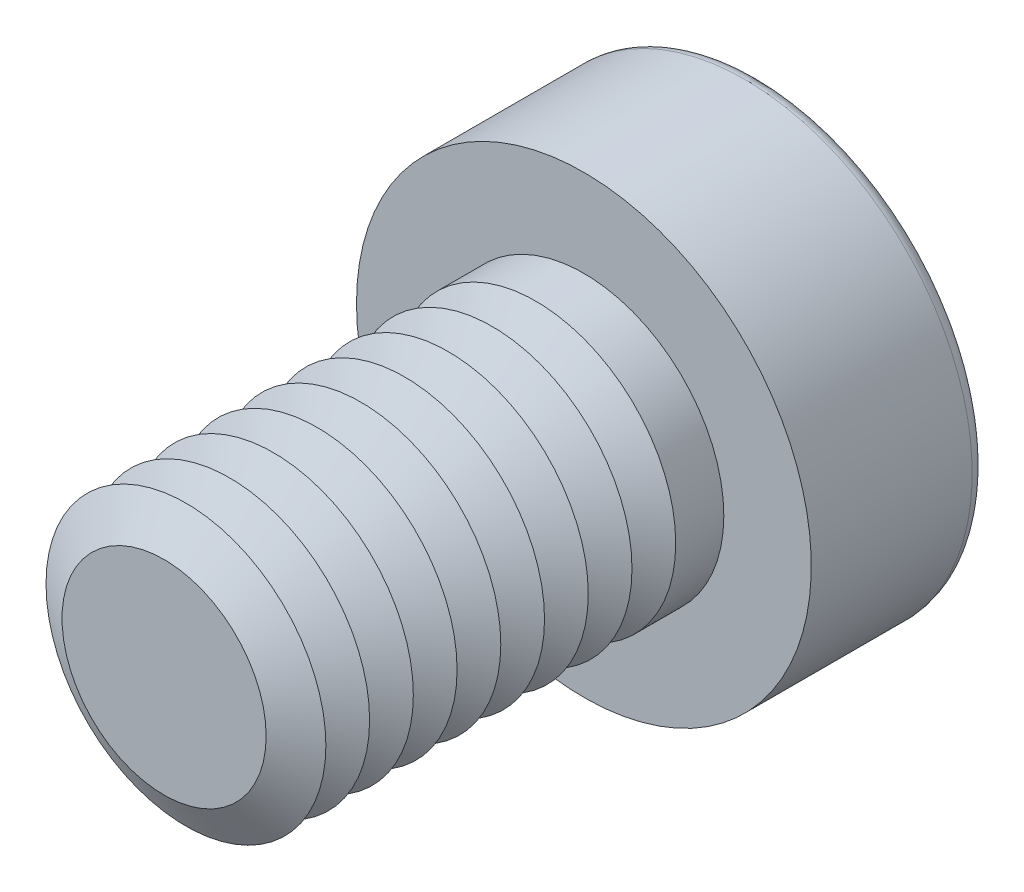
ISO-10303-21;
HEADER;
FILE_DESCRIPTION(('STEP AP214'),'2;1');
FILE_NAME('part.step','',(''),(''),'','','');
FILE_SCHEMA(('AUTOMOTIVE_DESIGN { 1 0 10303 214 1 1 1 1 }'));
ENDSEC;
DATA;
#1=APPLICATION_CONTEXT('core data for automotive mechanical design processes');
#2=APPLICATION_PROTOCOL_DEFINITION('international standard','automotive_design',2000,#1);
#3=PRODUCT_CONTEXT('',#1,'mechanical');
#4=PRODUCT('Part','Part','',(#3));
#5=PRODUCT_RELATED_PRODUCT_CATEGORY('part','',(#4));
#6=PRODUCT_DEFINITION_FORMATION('','',#4);
#7=PRODUCT_DEFINITION_CONTEXT('part definition',#1,'design');
#8=PRODUCT_DEFINITION('design','',#6,#7);
#9=PRODUCT_DEFINITION_SHAPE('','',#8);
#10=(LENGTH_UNIT() NAMED_UNIT(*) SI_UNIT(.MILLI.,.METRE.));
#11=(NAMED_UNIT(*) PLANE_ANGLE_UNIT() SI_UNIT($,.RADIAN.));
#12=(NAMED_UNIT(*) SI_UNIT($,.STERADIAN.) SOLID_ANGLE_UNIT());
#13=UNCERTAINTY_MEASURE_WITH_UNIT(LENGTH_MEASURE(1.E-05),#10,'distance_accuracy_value','');
#14=(GEOMETRIC_REPRESENTATION_CONTEXT(3) GLOBAL_UNCERTAINTY_ASSIGNED_CONTEXT((#13)) GLOBAL_UNIT_ASSIGNED_CONTEXT((#10,
#11,#12)) REPRESENTATION_CONTEXT('',''));
#15=CARTESIAN_POINT('',(0.,0.,0.));
#16=DIRECTION('',(0.,0.,1.));
#17=DIRECTION('',(1.,0.,0.));
#18=AXIS2_PLACEMENT_3D('',#15,#16,#17);
#19=CARTESIAN_POINT('',(0.,0.,7.625));
#20=DIRECTION('',(0.,0.,1.));
#21=DIRECTION('',(1.,0.,0.));
#22=AXIS2_PLACEMENT_3D('',#19,#20,#21);
#23=CONICAL_SURFACE('',#22,4.,1.0471975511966);
#24=CARTESIAN_POINT('',(0.,0.,7.));
#25=DIRECTION('',(0.,0.,1.));
#26=DIRECTION('',(1.,0.,0.));
#27=AXIS2_PLACEMENT_3D('',#24,#25,#26);
#28=CIRCLE('',#27,2.91746824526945);
#29=CARTESIAN_POINT('',(2.91746824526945,0.,7.));
#30=VERTEX_POINT('',#29);
#31=EDGE_CURVE('E314',#30,#30,#28,.T.);
#32=ORIENTED_EDGE('',*,*,#31,.T.);
#33=EDGE_LOOP('',(#32));
#34=FACE_BOUND('',#33,.T.);
#35=CARTESIAN_POINT('',(0.,0.,7.625));
#36=DIRECTION('',(0.,0.,1.));
#37=DIRECTION('',(1.,0.,0.));
#38=AXIS2_PLACEMENT_3D('',#35,#36,#37);
#39=CIRCLE('',#38,4.);
#40=CARTESIAN_POINT('',(4.,0.,7.625));
#41=VERTEX_POINT('',#40);
#42=EDGE_CURVE('E317',#41,#41,#39,.T.);
#43=ORIENTED_EDGE('',*,*,#42,.F.);
#44=EDGE_LOOP('',(#43));
#45=FACE_BOUND('',#44,.T.);
#46=ADVANCED_FACE('F39',(#34,#45),#23,.T.);
#47=CARTESIAN_POINT('',(0.,0.,7.));
#48=DIRECTION('',(0.,0.,-1.));
#49=DIRECTION('',(-1.,0.,0.));
#50=AXIS2_PLACEMENT_3D('',#47,#48,#49);
#51=CONICAL_SURFACE('',#50,2.91746824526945,1.0471975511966);
#52=CARTESIAN_POINT('',(0.,0.,6.375));
#53=DIRECTION('',(0.,0.,1.));
#54=DIRECTION('',(1.,0.,0.));
#55=AXIS2_PLACEMENT_3D('',#52,#53,#54);
#56=CIRCLE('',#55,4.);
#57=CARTESIAN_POINT('',(4.,0.,6.375));
#58=VERTEX_POINT('',#57);
#59=EDGE_CURVE('E325',#58,#58,#56,.T.);
#60=ORIENTED_EDGE('',*,*,#59,.T.);
#61=EDGE_LOOP('',(#60));
#62=FACE_BOUND('',#61,.T.);
#63=ORIENTED_EDGE('',*,*,#31,.F.);
#64=EDGE_LOOP('',(#63));
#65=FACE_BOUND('',#64,.T.);
#66=ADVANCED_FACE('F245',(#62,#65),#51,.T.);
#67=CARTESIAN_POINT('',(0.,0.,12.));
#68=DIRECTION('',(0.,0.,1.));
#69=DIRECTION('',(1.,0.,0.));
#70=AXIS2_PLACEMENT_3D('',#67,#68,#69);
#71=PLANE('',#70);
#72=CARTESIAN_POINT('',(0.,0.,12.));
#73=DIRECTION('',(0.,0.,1.));
#74=DIRECTION('',(1.,0.,0.));
#75=AXIS2_PLACEMENT_3D('',#72,#73,#74);
#76=CIRCLE('',#75,2.91746824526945);
#77=CARTESIAN_POINT('',(2.91746824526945,0.,12.));
#78=VERTEX_POINT('',#77);
#79=EDGE_CURVE('E174',#78,#78,#76,.T.);
#80=ORIENTED_EDGE('',*,*,#79,.T.);
#81=EDGE_LOOP('',(#80));
#82=FACE_BOUND('',#81,.T.);
#83=ADVANCED_FACE('F251',(#82),#71,.T.);
#84=CARTESIAN_POINT('',(0.,0.,12.));
#85=DIRECTION('',(0.,0.,-1.));
#86=DIRECTION('',(-1.,0.,0.));
#87=AXIS2_PLACEMENT_3D('',#84,#85,#86);
#88=CONICAL_SURFACE('',#87,2.91746824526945,1.0471975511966);
#89=CARTESIAN_POINT('',(0.,0.,11.375));
#90=DIRECTION('',(0.,0.,1.));
#91=DIRECTION('',(1.,0.,0.));
#92=AXIS2_PLACEMENT_3D('',#89,#90,#91);
#93=CIRCLE('',#92,4.);
#94=CARTESIAN_POINT('',(4.,0.,11.375));
#95=VERTEX_POINT('',#94);
#96=EDGE_CURVE('E291',#95,#95,#93,.T.);
#97=ORIENTED_EDGE('',*,*,#96,.T.);
#98=EDGE_LOOP('',(#97));
#99=FACE_BOUND('',#98,.T.);
#100=ORIENTED_EDGE('',*,*,#79,.F.);
#101=EDGE_LOOP('',(#100));
#102=FACE_BOUND('',#101,.T.);
#103=ADVANCED_FACE('F199',(#99,#102),#88,.T.);
#104=CARTESIAN_POINT('',(0.,0.,11.375));
#105=DIRECTION('',(0.,0.,1.));
#106=DIRECTION('',(1.,0.,0.));
#107=AXIS2_PLACEMENT_3D('',#104,#105,#106);
#108=CONICAL_SURFACE('',#107,4.,1.0471975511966);
#109=CARTESIAN_POINT('',(0.,0.,10.75));
#110=DIRECTION('',(0.,0.,1.));
#111=DIRECTION('',(1.,0.,0.));
#112=AXIS2_PLACEMENT_3D('',#109,#110,#111);
#113=CIRCLE('',#112,2.91746824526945);
#114=CARTESIAN_POINT('',(2.91746824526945,0.,10.75));
#115=VERTEX_POINT('',#114);
#116=EDGE_CURVE('E288',#115,#115,#113,.T.);
#117=ORIENTED_EDGE('',*,*,#116,.T.);
#118=EDGE_LOOP('',(#117));
#119=FACE_BOUND('',#118,.T.);
#120=ORIENTED_EDGE('',*,*,#96,.F.);
#121=EDGE_LOOP('',(#120));
#122=FACE_BOUND('',#121,.T.);
#123=ADVANCED_FACE('F277',(#119,#122),#108,.T.);
#124=CARTESIAN_POINT('',(0.,0.,10.75));
#125=DIRECTION('',(0.,0.,-1.));
#126=DIRECTION('',(-1.,0.,0.));
#127=AXIS2_PLACEMENT_3D('',#124,#125,#126);
#128=CONICAL_SURFACE('',#127,2.91746824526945,1.0471975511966);
#129=CARTESIAN_POINT('',(0.,0.,10.125));
#130=DIRECTION('',(0.,0.,1.));
#131=DIRECTION('',(1.,0.,0.));
#132=AXIS2_PLACEMENT_3D('',#129,#130,#131);
#133=CIRCLE('',#132,4.);
#134=CARTESIAN_POINT('',(4.,0.,10.125));
#135=VERTEX_POINT('',#134);
#136=EDGE_CURVE('E300',#135,#135,#133,.T.);
#137=ORIENTED_EDGE('',*,*,#136,.T.);
#138=EDGE_LOOP('',(#137));
#139=FACE_BOUND('',#138,.T.);
#140=ORIENTED_EDGE('',*,*,#116,.F.);
#141=EDGE_LOOP('',(#140));
#142=FACE_BOUND('',#141,.T.);
#143=ADVANCED_FACE('F274',(#139,#142),#128,.T.);
#144=CARTESIAN_POINT('',(0.,0.,10.125));
#145=DIRECTION('',(0.,0.,1.));
#146=DIRECTION('',(1.,0.,0.));
#147=AXIS2_PLACEMENT_3D('',#144,#145,#146);
#148=CONICAL_SURFACE('',#147,4.,1.0471975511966);
#149=CARTESIAN_POINT('',(0.,0.,9.5));
#150=DIRECTION('',(0.,0.,1.));
#151=DIRECTION('',(1.,0.,0.));
#152=AXIS2_PLACEMENT_3D('',#149,#150,#151);
#153=CIRCLE('',#152,2.91746824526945);
#154=CARTESIAN_POINT('',(2.91746824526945,0.,9.5));
#155=VERTEX_POINT('',#154);
#156=EDGE_CURVE('E293',#155,#155,#153,.T.);
#157=ORIENTED_EDGE('',*,*,#156,.T.);
#158=EDGE_LOOP('',(#157));
#159=FACE_BOUND('',#158,.T.);
#160=ORIENTED_EDGE('',*,*,#136,.F.);
#161=EDGE_LOOP('',(#160));
#162=FACE_BOUND('',#161,.T.);
#163=ADVANCED_FACE('F270',(#159,#162),#148,.T.);
#164=CARTESIAN_POINT('',(0.,0.,9.5));
#165=DIRECTION('',(0.,0.,-1.));
#166=DIRECTION('',(-1.,0.,0.));
#167=AXIS2_PLACEMENT_3D('',#164,#165,#166);
#168=CONICAL_SURFACE('',#167,2.91746824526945,1.0471975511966);
#169=CARTESIAN_POINT('',(0.,0.,8.875));
#170=DIRECTION('',(0.,0.,1.));
#171=DIRECTION('',(1.,0.,0.));
#172=AXIS2_PLACEMENT_3D('',#169,#170,#171);
#173=CIRCLE('',#172,4.);
#174=CARTESIAN_POINT('',(4.,0.,8.875));
#175=VERTEX_POINT('',#174);
#176=EDGE_CURVE('E310',#175,#175,#173,.T.);
#177=ORIENTED_EDGE('',*,*,#176,.T.);
#178=EDGE_LOOP('',(#177));
#179=FACE_BOUND('',#178,.T.);
#180=ORIENTED_EDGE('',*,*,#156,.F.);
#181=EDGE_LOOP('',(#180));
#182=FACE_BOUND('',#181,.T.);
#183=ADVANCED_FACE('F266',(#179,#182),#168,.T.);
#184=CARTESIAN_POINT('',(0.,0.,8.875));
#185=DIRECTION('',(0.,0.,1.));
#186=DIRECTION('',(1.,0.,0.));
#187=AXIS2_PLACEMENT_3D('',#184,#185,#186);
#188=CONICAL_SURFACE('',#187,4.,1.0471975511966);
#189=CARTESIAN_POINT('',(0.,0.,8.25));
#190=DIRECTION('',(0.,0.,1.));
#191=DIRECTION('',(1.,0.,0.));
#192=AXIS2_PLACEMENT_3D('',#189,#190,#191);
#193=CIRCLE('',#192,2.91746824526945);
#194=CARTESIAN_POINT('',(2.91746824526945,0.,8.25));
#195=VERTEX_POINT('',#194);
#196=EDGE_CURVE('E306',#195,#195,#193,.T.);
#197=ORIENTED_EDGE('',*,*,#196,.T.);
#198=EDGE_LOOP('',(#197));
#199=FACE_BOUND('',#198,.T.);
#200=ORIENTED_EDGE('',*,*,#176,.F.);
#201=EDGE_LOOP('',(#200));
#202=FACE_BOUND('',#201,.T.);
#203=ADVANCED_FACE('F262',(#199,#202),#188,.T.);
#204=CARTESIAN_POINT('',(0.,0.,8.25));
#205=DIRECTION('',(0.,0.,-1.));
#206=DIRECTION('',(-1.,0.,0.));
#207=AXIS2_PLACEMENT_3D('',#204,#205,#206);
#208=CONICAL_SURFACE('',#207,2.91746824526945,1.0471975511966);
#209=ORIENTED_EDGE('',*,*,#42,.T.);
#210=EDGE_LOOP('',(#209));
#211=FACE_BOUND('',#210,.T.);
#212=ORIENTED_EDGE('',*,*,#196,.F.);
#213=EDGE_LOOP('',(#212));
#214=FACE_BOUND('',#213,.T.);
#215=ADVANCED_FACE('F258',(#211,#214),#208,.T.);
#216=CARTESIAN_POINT('',(0.,0.,6.375));
#217=DIRECTION('',(0.,0.,1.));
#218=DIRECTION('',(1.,0.,0.));
#219=AXIS2_PLACEMENT_3D('',#216,#217,#218);
#220=CONICAL_SURFACE('',#219,4.,1.0471975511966);
#221=CARTESIAN_POINT('',(0.,0.,5.75));
#222=DIRECTION('',(0.,0.,1.));
#223=DIRECTION('',(1.,0.,0.));
#224=AXIS2_PLACEMENT_3D('',#221,#222,#223);
#225=CIRCLE('',#224,2.91746824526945);
#226=CARTESIAN_POINT('',(2.91746824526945,0.,5.75));
#227=VERTEX_POINT('',#226);
#228=EDGE_CURVE('E321',#227,#227,#225,.T.);
#229=ORIENTED_EDGE('',*,*,#228,.T.);
#230=EDGE_LOOP('',(#229));
#231=FACE_BOUND('',#230,.T.);
#232=ORIENTED_EDGE('',*,*,#59,.F.);
#233=EDGE_LOOP('',(#232));
#234=FACE_BOUND('',#233,.T.);
#235=ADVANCED_FACE('F261',(#231,#234),#220,.T.);
#236=CARTESIAN_POINT('',(0.,0.,5.75));
#237=DIRECTION('',(0.,0.,-1.));
#238=DIRECTION('',(-1.,0.,0.));
#239=AXIS2_PLACEMENT_3D('',#236,#237,#238);
#240=CONICAL_SURFACE('',#239,2.91746824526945,1.0471975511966);
#241=CARTESIAN_POINT('',(0.,0.,5.125));
#242=DIRECTION('',(0.,0.,1.));
#243=DIRECTION('',(1.,0.,0.));
#244=AXIS2_PLACEMENT_3D('',#241,#242,#243);
#245=CIRCLE('',#244,4.);
#246=CARTESIAN_POINT('',(4.,0.,5.125));
#247=VERTEX_POINT('',#246);
#248=EDGE_CURVE('E332',#247,#247,#245,.T.);
#249=ORIENTED_EDGE('',*,*,#248,.T.);
#250=EDGE_LOOP('',(#249));
#251=FACE_BOUND('',#250,.T.);
#252=ORIENTED_EDGE('',*,*,#228,.F.);
#253=EDGE_LOOP('',(#252));
#254=FACE_BOUND('',#253,.T.);
#255=ADVANCED_FACE('F386',(#251,#254),#240,.T.);
#256=CARTESIAN_POINT('',(0.,0.,5.125));
#257=DIRECTION('',(0.,0.,1.));
#258=DIRECTION('',(1.,0.,0.));
#259=AXIS2_PLACEMENT_3D('',#256,#257,#258);
#260=CONICAL_SURFACE('',#259,4.,1.0471975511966);
#261=CARTESIAN_POINT('',(0.,0.,4.5));
#262=DIRECTION('',(0.,0.,1.));
#263=DIRECTION('',(1.,0.,0.));
#264=AXIS2_PLACEMENT_3D('',#261,#262,#263);
#265=CIRCLE('',#264,2.91746824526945);
#266=CARTESIAN_POINT('',(2.91746824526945,0.,4.5));
#267=VERTEX_POINT('',#266);
#268=EDGE_CURVE('E328',#267,#267,#265,.T.);
#269=ORIENTED_EDGE('',*,*,#268,.T.);
#270=EDGE_LOOP('',(#269));
#271=FACE_BOUND('',#270,.T.);
#272=ORIENTED_EDGE('',*,*,#248,.F.);
#273=EDGE_LOOP('',(#272));
#274=FACE_BOUND('',#273,.T.);
#275=ADVANCED_FACE('F382',(#271,#274),#260,.T.);
#276=CARTESIAN_POINT('',(0.,0.,4.5));
#277=DIRECTION('',(0.,0.,-1.));
#278=DIRECTION('',(-1.,0.,0.));
#279=AXIS2_PLACEMENT_3D('',#276,#277,#278);
#280=CONICAL_SURFACE('',#279,2.91746824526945,1.0471975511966);
#281=CARTESIAN_POINT('',(0.,0.,3.875));
#282=DIRECTION('',(0.,0.,1.));
#283=DIRECTION('',(1.,0.,0.));
#284=AXIS2_PLACEMENT_3D('',#281,#282,#283);
#285=CIRCLE('',#284,4.);
#286=CARTESIAN_POINT('',(4.,0.,3.875));
#287=VERTEX_POINT('',#286);
#288=EDGE_CURVE('E340',#287,#287,#285,.T.);
#289=ORIENTED_EDGE('',*,*,#288,.T.);
#290=EDGE_LOOP('',(#289));
#291=FACE_BOUND('',#290,.T.);
#292=ORIENTED_EDGE('',*,*,#268,.F.);
#293=EDGE_LOOP('',(#292));
#294=FACE_BOUND('',#293,.T.);
#295=ADVANCED_FACE('F378',(#291,#294),#280,.T.);
#296=CARTESIAN_POINT('',(0.,0.,3.875));
#297=DIRECTION('',(0.,0.,1.));
#298=DIRECTION('',(1.,0.,0.));
#299=AXIS2_PLACEMENT_3D('',#296,#297,#298);
#300=CONICAL_SURFACE('',#299,4.,1.0471975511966);
#301=CARTESIAN_POINT('',(0.,0.,3.25));
#302=DIRECTION('',(0.,0.,1.));
#303=DIRECTION('',(1.,0.,0.));
#304=AXIS2_PLACEMENT_3D('',#301,#302,#303);
#305=CIRCLE('',#304,2.91746824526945);
#306=CARTESIAN_POINT('',(2.91746824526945,0.,3.25));
#307=VERTEX_POINT('',#306);
#308=EDGE_CURVE('E336',#307,#307,#305,.T.);
#309=ORIENTED_EDGE('',*,*,#308,.T.);
#310=EDGE_LOOP('',(#309));
#311=FACE_BOUND('',#310,.T.);
#312=ORIENTED_EDGE('',*,*,#288,.F.);
#313=EDGE_LOOP('',(#312));
#314=FACE_BOUND('',#313,.T.);
#315=ADVANCED_FACE('F373',(#311,#314),#300,.T.);
#316=CARTESIAN_POINT('',(0.,0.,3.25));
#317=DIRECTION('',(0.,0.,-1.));
#318=DIRECTION('',(-1.,0.,0.));
#319=AXIS2_PLACEMENT_3D('',#316,#317,#318);
#320=CONICAL_SURFACE('',#319,2.91746824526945,1.0471975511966);
#321=CARTESIAN_POINT('',(0.,0.,2.625));
#322=DIRECTION('',(0.,0.,1.));
#323=DIRECTION('',(1.,0.,0.));
#324=AXIS2_PLACEMENT_3D('',#321,#322,#323);
#325=CIRCLE('',#324,4.);
#326=CARTESIAN_POINT('',(4.,0.,2.625));
#327=VERTEX_POINT('',#326);
#328=EDGE_CURVE('E352',#327,#327,#325,.T.);
#329=ORIENTED_EDGE('',*,*,#328,.T.);
#330=EDGE_LOOP('',(#329));
#331=FACE_BOUND('',#330,.T.);
#332=ORIENTED_EDGE('',*,*,#308,.F.);
#333=EDGE_LOOP('',(#332));
#334=FACE_BOUND('',#333,.T.);
#335=ADVANCED_FACE('F359',(#331,#334),#320,.T.);
#336=CARTESIAN_POINT('',(0.,0.,2.625));
#337=DIRECTION('',(0.,0.,1.));
#338=DIRECTION('',(1.,0.,0.));
#339=AXIS2_PLACEMENT_3D('',#336,#337,#338);
#340=CONICAL_SURFACE('',#339,4.,1.0471975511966);
#341=CARTESIAN_POINT('',(0.,0.,2.));
#342=DIRECTION('',(0.,0.,1.));
#343=DIRECTION('',(1.,0.,0.));
#344=AXIS2_PLACEMENT_3D('',#341,#342,#343);
#345=CIRCLE('',#344,2.91746824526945);
#346=CARTESIAN_POINT('',(2.91746824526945,0.,2.));
#347=VERTEX_POINT('',#346);
#348=EDGE_CURVE('E344',#347,#347,#345,.T.);
#349=ORIENTED_EDGE('',*,*,#348,.T.);
#350=EDGE_LOOP('',(#349));
#351=FACE_BOUND('',#350,.T.);
#352=ORIENTED_EDGE('',*,*,#328,.F.);
#353=EDGE_LOOP('',(#352));
#354=FACE_BOUND('',#353,.T.);
#355=ADVANCED_FACE('F362',(#351,#354),#340,.T.);
#356=CARTESIAN_POINT('',(0.,0.,2.));
#357=DIRECTION('',(0.,0.,-1.));
#358=DIRECTION('',(-1.,0.,0.));
#359=AXIS2_PLACEMENT_3D('',#356,#357,#358);
#360=CONICAL_SURFACE('',#359,2.91746824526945,1.0471975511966);
#361=CARTESIAN_POINT('',(0.,0.,1.375));
#362=DIRECTION('',(0.,0.,1.));
#363=DIRECTION('',(1.,0.,0.));
#364=AXIS2_PLACEMENT_3D('',#361,#362,#363);
#365=CIRCLE('',#364,4.);
#366=CARTESIAN_POINT('',(4.,0.,1.375));
#367=VERTEX_POINT('',#366);
#368=EDGE_CURVE('E348',#367,#367,#365,.T.);
#369=ORIENTED_EDGE('',*,*,#368,.T.);
#370=EDGE_LOOP('',(#369));
#371=FACE_BOUND('',#370,.T.);
#372=ORIENTED_EDGE('',*,*,#348,.F.);
#373=EDGE_LOOP('',(#372));
#374=FACE_BOUND('',#373,.T.);
#375=ADVANCED_FACE('F364',(#371,#374),#360,.T.);
#376=CARTESIAN_POINT('',(0.,0.,-1.25));
#377=DIRECTION('',(0.,0.,-1.));
#378=DIRECTION('',(-1.,0.,0.));
#379=AXIS2_PLACEMENT_3D('',#376,#377,#378);
#380=CONICAL_SURFACE('',#379,2.5,1.0471975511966);
#381=CARTESIAN_POINT('',(0.,0.,0.193375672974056));
#382=VERTEX_POINT('',#381);
#383=VERTEX_LOOP('',#382);
#384=FACE_BOUND('',#383,.T.);
#385=CARTESIAN_POINT('',(0.,0.,-1.25));
#386=DIRECTION('',(0.,0.,-1.));
#387=DIRECTION('',(-1.,0.,0.));
#388=AXIS2_PLACEMENT_3D('',#385,#386,#387);
#389=CIRCLE('',#388,2.5);
#390=CARTESIAN_POINT('',(-2.1650635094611,1.25,-1.25));
#391=VERTEX_POINT('',#390);
#392=CARTESIAN_POINT('',(0.,2.5,-1.25));
#393=VERTEX_POINT('',#392);
#394=EDGE_CURVE('E149',#391,#393,#389,.T.);
#395=ORIENTED_EDGE('',*,*,#394,.T.);
#396=CARTESIAN_POINT('',(0.,0.,-1.25));
#397=DIRECTION('',(0.,0.,-1.));
#398=DIRECTION('',(-1.,0.,0.));
#399=AXIS2_PLACEMENT_3D('',#396,#397,#398);
#400=CIRCLE('',#399,2.5);
#401=CARTESIAN_POINT('',(2.1650635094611,1.25,-1.25));
#402=VERTEX_POINT('',#401);
#403=EDGE_CURVE('E54',#393,#402,#400,.T.);
#404=ORIENTED_EDGE('',*,*,#403,.T.);
#405=CARTESIAN_POINT('',(2.1650635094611,-1.25,-1.25));
#406=VERTEX_POINT('',#405);
#407=EDGE_CURVE('E789',#402,#406,#400,.T.);
#408=ORIENTED_EDGE('',*,*,#407,.T.);
#409=CARTESIAN_POINT('',(0.,-2.5,-1.25));
#410=VERTEX_POINT('',#409);
#411=EDGE_CURVE('E787',#406,#410,#400,.T.);
#412=ORIENTED_EDGE('',*,*,#411,.T.);
#413=CARTESIAN_POINT('',(-2.1650635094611,-1.25,-1.25));
#414=VERTEX_POINT('',#413);
#415=EDGE_CURVE('E782',#410,#414,#400,.T.);
#416=ORIENTED_EDGE('',*,*,#415,.T.);
#417=EDGE_CURVE('E781',#414,#391,#400,.T.);
#418=ORIENTED_EDGE('',*,*,#417,.T.);
#419=EDGE_LOOP('',(#395,#404,#408,#412,#416,#418));
#420=FACE_BOUND('',#419,.T.);
#421=ADVANCED_FACE('F201',(#384,#420),#380,.F.);
#422=CARTESIAN_POINT('',(0.,0.,-1.25));
#423=DIRECTION('',(0.,0.,-1.));
#424=DIRECTION('',(-1.,0.,0.));
#425=AXIS2_PLACEMENT_3D('',#422,#423,#424);
#426=PLANE('',#425);
#427=ORIENTED_EDGE('',*,*,#403,.F.);
#428=DIRECTION('',(1.,0.,0.));
#429=VECTOR('',#428,1.);
#430=CARTESIAN_POINT('',(-1.44337567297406,2.5,-1.25));
#431=LINE('',#430,#429);
#432=CARTESIAN_POINT('',(1.44337567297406,2.5,-1.25));
#433=VERTEX_POINT('',#432);
#434=EDGE_CURVE('E822',#393,#433,#431,.T.);
#435=ORIENTED_EDGE('',*,*,#434,.T.);
#436=DIRECTION('',(0.5,-0.866025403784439,0.));
#437=VECTOR('',#436,1.);
#438=CARTESIAN_POINT('',(1.44337567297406,2.5,-1.25));
#439=LINE('',#438,#437);
#440=EDGE_CURVE('E155',#433,#402,#439,.T.);
#441=ORIENTED_EDGE('',*,*,#440,.T.);
#442=EDGE_LOOP('',(#427,#435,#441));
#443=FACE_BOUND('',#442,.T.);
#444=ADVANCED_FACE('F433',(#443),#426,.T.);
#445=ORIENTED_EDGE('',*,*,#407,.F.);
#446=CARTESIAN_POINT('',(2.88675134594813,0.,-1.25));
#447=VERTEX_POINT('',#446);
#448=EDGE_CURVE('E824',#402,#447,#439,.T.);
#449=ORIENTED_EDGE('',*,*,#448,.T.);
#450=DIRECTION('',(-0.5,-0.866025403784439,0.));
#451=VECTOR('',#450,1.);
#452=CARTESIAN_POINT('',(2.88675134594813,0.,-1.25));
#453=LINE('',#452,#451);
#454=EDGE_CURVE('E800',#447,#406,#453,.T.);
#455=ORIENTED_EDGE('',*,*,#454,.T.);
#456=EDGE_LOOP('',(#445,#449,#455));
#457=FACE_BOUND('',#456,.T.);
#458=ADVANCED_FACE('F443',(#457),#426,.T.);
#459=ORIENTED_EDGE('',*,*,#411,.F.);
#460=CARTESIAN_POINT('',(1.44337567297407,-2.5,-1.25));
#461=VERTEX_POINT('',#460);
#462=EDGE_CURVE('E802',#406,#461,#453,.T.);
#463=ORIENTED_EDGE('',*,*,#462,.T.);
#464=DIRECTION('',(-1.,0.,0.));
#465=VECTOR('',#464,1.);
#466=CARTESIAN_POINT('',(1.44337567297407,-2.5,-1.25));
#467=LINE('',#466,#465);
#468=EDGE_CURVE('E756',#461,#410,#467,.T.);
#469=ORIENTED_EDGE('',*,*,#468,.T.);
#470=EDGE_LOOP('',(#459,#463,#469));
#471=FACE_BOUND('',#470,.T.);
#472=ADVANCED_FACE('F453',(#471),#426,.T.);
#473=ORIENTED_EDGE('',*,*,#415,.F.);
#474=CARTESIAN_POINT('',(-1.44337567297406,-2.5,-1.25));
#475=VERTEX_POINT('',#474);
#476=EDGE_CURVE('E797',#410,#475,#467,.T.);
#477=ORIENTED_EDGE('',*,*,#476,.T.);
#478=DIRECTION('',(-0.5,0.866025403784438,0.));
#479=VECTOR('',#478,1.);
#480=CARTESIAN_POINT('',(-1.44337567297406,-2.5,-1.25));
#481=LINE('',#480,#479);
#482=EDGE_CURVE('E799',#475,#414,#481,.T.);
#483=ORIENTED_EDGE('',*,*,#482,.T.);
#484=EDGE_LOOP('',(#473,#477,#483));
#485=FACE_BOUND('',#484,.T.);
#486=ADVANCED_FACE('F461',(#485),#426,.T.);
#487=ORIENTED_EDGE('',*,*,#417,.F.);
#488=CARTESIAN_POINT('',(-2.88675134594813,0.,-1.25));
#489=VERTEX_POINT('',#488);
#490=EDGE_CURVE('E803',#414,#489,#481,.T.);
#491=ORIENTED_EDGE('',*,*,#490,.T.);
#492=DIRECTION('',(0.5,0.866025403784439,0.));
#493=VECTOR('',#492,1.);
#494=CARTESIAN_POINT('',(-2.88675134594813,0.,-1.25));
#495=LINE('',#494,#493);
#496=EDGE_CURVE('E158',#489,#391,#495,.T.);
#497=ORIENTED_EDGE('',*,*,#496,.T.);
#498=EDGE_LOOP('',(#487,#491,#497));
#499=FACE_BOUND('',#498,.T.);
#500=ADVANCED_FACE('F231',(#499),#426,.T.);
#501=ORIENTED_EDGE('',*,*,#394,.F.);
#502=CARTESIAN_POINT('',(-1.44337567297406,2.5,-1.25));
#503=VERTEX_POINT('',#502);
#504=EDGE_CURVE('E809',#391,#503,#495,.T.);
#505=ORIENTED_EDGE('',*,*,#504,.T.);
#506=EDGE_CURVE('E826',#503,#393,#431,.T.);
#507=ORIENTED_EDGE('',*,*,#506,.T.);
#508=EDGE_LOOP('',(#501,#505,#507));
#509=FACE_BOUND('',#508,.T.);
#510=ADVANCED_FACE('F445',(#509),#426,.T.);
#511=CARTESIAN_POINT('',(-1.44337567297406,2.5,-1.25));
#512=DIRECTION('',(0.,1.,0.));
#513=DIRECTION('',(-1.,0.,0.));
#514=AXIS2_PLACEMENT_3D('',#511,#512,#513);
#515=PLANE('',#514);
#516=DIRECTION('',(0.,0.,-1.));
#517=VECTOR('',#516,1.);
#518=CARTESIAN_POINT('',(-1.44337567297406,2.5,-1.25));
#519=LINE('',#518,#517);
#520=CARTESIAN_POINT('',(-1.44337567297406,2.5,-5.));
#521=VERTEX_POINT('',#520);
#522=EDGE_CURVE('E147',#503,#521,#519,.T.);
#523=ORIENTED_EDGE('',*,*,#522,.T.);
#524=CARTESIAN_POINT('',(-3.76800948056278,2.5,-5.43814611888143));
#525=CARTESIAN_POINT('',(-3.65512241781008,2.5,-5.41294788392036));
#526=CARTESIAN_POINT('',(-3.54216337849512,2.5,-5.38806689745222));
#527=CARTESIAN_POINT('',(-3.31606595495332,2.5,-5.33910944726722));
#528=CARTESIAN_POINT('',(-3.202927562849,2.5,-5.31503301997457));
#529=CARTESIAN_POINT('',(-2.97632910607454,2.5,-5.26783262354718));
#530=CARTESIAN_POINT('',(-2.86286882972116,2.5,-5.24470966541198));
#531=CARTESIAN_POINT('',(-2.63570880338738,2.5,-5.19967851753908));
#532=CARTESIAN_POINT('',(-2.522009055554,2.5,-5.17777031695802));
#533=CARTESIAN_POINT('',(-2.18246936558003,2.5,-5.11464083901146));
#534=CARTESIAN_POINT('',(-1.95621666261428,2.5,-5.07559469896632));
#535=CARTESIAN_POINT('',(-1.50233128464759,2.5,-5.00642421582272));
#536=CARTESIAN_POINT('',(-1.27469889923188,2.5,-4.97629806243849));
#537=CARTESIAN_POINT('',(-0.930935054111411,2.5,-4.9407375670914));
#538=CARTESIAN_POINT('',(-0.815306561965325,2.5,-4.93045885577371));
#539=CARTESIAN_POINT('',(-0.583775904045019,2.5,-4.91374261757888));
#540=CARTESIAN_POINT('',(-0.467873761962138,2.5,-4.9073047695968));
#541=CARTESIAN_POINT('',(-0.235955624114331,2.5,-4.89864425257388));
#542=CARTESIAN_POINT('',(-0.119939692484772,2.5,-4.89641989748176));
#543=CARTESIAN_POINT('',(0.11209426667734,2.5,-4.89632233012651));
#544=CARTESIAN_POINT('',(0.228112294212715,2.5,-4.89844912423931));
#545=CARTESIAN_POINT('',(0.460464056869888,2.5,-4.90693624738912));
#546=CARTESIAN_POINT('',(0.576797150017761,2.5,-4.91331380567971));
#547=CARTESIAN_POINT('',(0.809186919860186,2.5,-4.92994602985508));
#548=CARTESIAN_POINT('',(0.925243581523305,2.5,-4.94020090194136));
#549=CARTESIAN_POINT('',(1.1570783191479,2.5,-4.96408095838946));
#550=CARTESIAN_POINT('',(1.27285617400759,2.5,-4.97770825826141));
#551=CARTESIAN_POINT('',(1.50403978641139,2.5,-5.0077859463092));
#552=CARTESIAN_POINT('',(1.61944554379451,2.5,-5.02423633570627));
#553=CARTESIAN_POINT('',(1.97116037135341,2.5,-5.07794848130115));
#554=CARTESIAN_POINT('',(2.20690405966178,2.5,-5.11889404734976));
#555=CARTESIAN_POINT('',(2.67723558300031,2.5,-5.2069642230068));
#556=CARTESIAN_POINT('',(2.9118232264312,2.5,-5.25408982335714));
#557=CARTESIAN_POINT('',(3.38022088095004,2.5,-5.35235327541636));
#558=CARTESIAN_POINT('',(3.61403064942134,2.5,-5.40349227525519));
#559=CARTESIAN_POINT('',(4.08105387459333,2.5,-5.50842823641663));
#560=CARTESIAN_POINT('',(4.31426731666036,2.5,-5.56222526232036));
#561=CARTESIAN_POINT('',(4.77742011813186,2.5,-5.67097662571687));
#562=CARTESIAN_POINT('',(5.00736469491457,2.5,-5.72590882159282));
#563=CARTESIAN_POINT('',(5.46695141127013,2.5,-5.83704335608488));
#564=CARTESIAN_POINT('',(5.69659354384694,2.5,-5.89324572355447));
#565=CARTESIAN_POINT('',(6.15532898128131,2.5,-6.00649703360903));
#566=CARTESIAN_POINT('',(6.3844226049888,2.5,-6.06354468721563));
#567=CARTESIAN_POINT('',(6.84242442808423,2.5,-6.17834514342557));
#568=CARTESIAN_POINT('',(7.07133263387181,2.5,-6.23609792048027));
#569=CARTESIAN_POINT('',(7.30017784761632,2.5,-6.29409642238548));
#570=B_SPLINE_CURVE_WITH_KNOTS('',3,(#524,#525,#526,#527,#528,#529,#530,#531,#532,#533,#534,
#535,#536,#537,#538,#539,#540,#541,#542,#543,#544,#545,#546,#547,#548,#549,#550,#551,#552,#553,
#554,#555,#556,#557,#558,#559,#560,#561,#562,#563,#564,#565,#566,#567,#568,#569),.UNSPECIFIED.,
.F.,.F.,(4,2,2,2,2,2,2,2,2,2,2,2,2,2,2,2,2,2,2,2,2,2,4),(0.,0.346996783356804,0.694009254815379,
1.04138068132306,1.38874900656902,2.07743762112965,2.76598637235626,3.11418615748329,
3.46235682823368,3.81038814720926,4.15841997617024,4.50787110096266,4.85734081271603,
5.2070303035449,5.55671994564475,6.27438533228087,6.99216591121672,7.71015258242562,
8.42815670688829,9.13739674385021,9.84665290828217,10.5549206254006,11.2631627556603),.UNSPECIFIED.);
#571=CARTESIAN_POINT('',(1.44337567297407,2.5,-5.));
#572=VERTEX_POINT('',#571);
#573=EDGE_CURVE('E124',#521,#572,#570,.T.);
#574=ORIENTED_EDGE('',*,*,#573,.T.);
#575=DIRECTION('',(0.,0.,-1.));
#576=VECTOR('',#575,1.);
#577=CARTESIAN_POINT('',(1.44337567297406,2.5,-1.25));
#578=LINE('',#577,#576);
#579=EDGE_CURVE('E143',#433,#572,#578,.T.);
#580=ORIENTED_EDGE('',*,*,#579,.F.);
#581=ORIENTED_EDGE('',*,*,#434,.F.);
#582=ORIENTED_EDGE('',*,*,#506,.F.);
#583=EDGE_LOOP('',(#523,#574,#580,#581,#582));
#584=FACE_BOUND('',#583,.T.);
#585=ADVANCED_FACE('F141',(#584),#515,.F.);
#586=CARTESIAN_POINT('',(1.44337567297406,2.5,-1.25));
#587=DIRECTION('',(0.866025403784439,0.5,0.));
#588=DIRECTION('',(-0.5,0.866025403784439,0.));
#589=AXIS2_PLACEMENT_3D('',#586,#587,#588);
#590=PLANE('',#589);
#591=ORIENTED_EDGE('',*,*,#579,.T.);
#592=CARTESIAN_POINT('',(1.44326020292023,2.5002,-5.00003094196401));
#593=CARTESIAN_POINT('',(1.50320952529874,2.3963647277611,-4.98395956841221));
#594=CARTESIAN_POINT('',(1.56326755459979,2.29234116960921,-4.96936932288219));
#595=CARTESIAN_POINT('',(1.68359574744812,2.08392662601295,-4.94373552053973));
#596=CARTESIAN_POINT('',(1.7438659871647,1.97953550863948,-4.93269340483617));
#597=CARTESIAN_POINT('',(1.86425311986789,1.77101887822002,-4.91480059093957));
#598=CARTESIAN_POINT('',(1.9243691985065,1.66689477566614,-4.90792855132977));
#599=CARTESIAN_POINT('',(2.04467803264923,1.45851376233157,-4.89871383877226));
#600=CARTESIAN_POINT('',(2.10487077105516,1.35425688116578,-4.89637028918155));
#601=CARTESIAN_POINT('',(2.22525624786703,1.14574311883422,-4.89637028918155));
#602=CARTESIAN_POINT('',(2.28544898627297,1.04148623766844,-4.89871383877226));
#603=CARTESIAN_POINT('',(2.40575782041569,0.833105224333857,-4.90792855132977));
#604=CARTESIAN_POINT('',(2.4658738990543,0.728981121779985,-4.91480059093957));
#605=CARTESIAN_POINT('',(2.58626103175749,0.520464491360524,-4.93269340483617));
#606=CARTESIAN_POINT('',(2.64653127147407,0.416073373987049,-4.94373552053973));
#607=CARTESIAN_POINT('',(2.7668594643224,0.207658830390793,-4.96936932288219));
#608=CARTESIAN_POINT('',(2.82691749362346,0.103635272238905,-4.98395956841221));
#609=CARTESIAN_POINT('',(2.88686681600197,-0.000199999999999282,-5.00003094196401));
#610=B_SPLINE_CURVE_WITH_KNOTS('',3,(#592,#593,#594,#595,#596,#597,#598,#599,#600,#601,#602,
#603,#604,#605,#606,#607,#608,#609),.UNSPECIFIED.,.F.,.F.,(4,2,2,2,2,2,2,2,4),(0.,
0.362931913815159,0.726011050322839,1.08721601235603,1.44835104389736,1.80948607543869,
2.17069103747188,2.53377017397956,2.89670208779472),.UNSPECIFIED.);
#611=CARTESIAN_POINT('',(2.88675134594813,0.,-5.));
#612=VERTEX_POINT('',#611);
#613=EDGE_CURVE('E11',#572,#612,#610,.T.);
#614=ORIENTED_EDGE('',*,*,#613,.T.);
#615=DIRECTION('',(0.,0.,-1.));
#616=VECTOR('',#615,1.);
#617=CARTESIAN_POINT('',(2.88675134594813,0.,-1.25));
#618=LINE('',#617,#616);
#619=EDGE_CURVE('E157',#447,#612,#618,.T.);
#620=ORIENTED_EDGE('',*,*,#619,.F.);
#621=ORIENTED_EDGE('',*,*,#448,.F.);
#622=ORIENTED_EDGE('',*,*,#440,.F.);
#623=EDGE_LOOP('',(#591,#614,#620,#621,#622));
#624=FACE_BOUND('',#623,.T.);
#625=ADVANCED_FACE('F152',(#624),#590,.F.);
#626=CARTESIAN_POINT('',(2.88675134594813,0.,-1.25));
#627=DIRECTION('',(0.866025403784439,-0.5,0.));
#628=DIRECTION('',(0.5,0.866025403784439,0.));
#629=AXIS2_PLACEMENT_3D('',#626,#627,#628);
#630=PLANE('',#629);
#631=ORIENTED_EDGE('',*,*,#619,.T.);
#632=CARTESIAN_POINT('',(2.88686681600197,0.000200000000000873,-5.00003094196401));
#633=CARTESIAN_POINT('',(2.82691749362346,-0.103635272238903,-4.98395956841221));
#634=CARTESIAN_POINT('',(2.7668594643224,-0.207658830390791,-4.96936932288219));
#635=CARTESIAN_POINT('',(2.64653127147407,-0.416073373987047,-4.94373552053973));
#636=CARTESIAN_POINT('',(2.58626103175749,-0.520464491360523,-4.93269340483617));
#637=CARTESIAN_POINT('',(2.4658738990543,-0.728981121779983,-4.91480059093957));
#638=CARTESIAN_POINT('',(2.40575782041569,-0.833105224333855,-4.90792855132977));
#639=CARTESIAN_POINT('',(2.28544898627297,-1.04148623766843,-4.89871383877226));
#640=CARTESIAN_POINT('',(2.22525624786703,-1.14574311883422,-4.89637028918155));
#641=CARTESIAN_POINT('',(2.10487077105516,-1.35425688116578,-4.89637028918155));
#642=CARTESIAN_POINT('',(2.04467803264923,-1.45851376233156,-4.89871383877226));
#643=CARTESIAN_POINT('',(1.9243691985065,-1.66689477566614,-4.90792855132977));
#644=CARTESIAN_POINT('',(1.86425311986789,-1.77101887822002,-4.91480059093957));
#645=CARTESIAN_POINT('',(1.74386598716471,-1.97953550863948,-4.93269340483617));
#646=CARTESIAN_POINT('',(1.68359574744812,-2.08392662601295,-4.94373552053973));
#647=CARTESIAN_POINT('',(1.56326755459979,-2.29234116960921,-4.96936932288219));
#648=CARTESIAN_POINT('',(1.50320952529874,-2.3963647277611,-4.98395956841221));
#649=CARTESIAN_POINT('',(1.44326020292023,-2.5002,-5.00003094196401));
#650=B_SPLINE_CURVE_WITH_KNOTS('',3,(#632,#633,#634,#635,#636,#637,#638,#639,#640,#641,#642,
#643,#644,#645,#646,#647,#648,#649),.UNSPECIFIED.,.F.,.F.,(4,2,2,2,2,2,2,2,4),(0.,
0.362931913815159,0.726011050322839,1.08721601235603,1.44835104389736,1.80948607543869,
2.17069103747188,2.53377017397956,2.89670208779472),.UNSPECIFIED.);
#651=CARTESIAN_POINT('',(1.44337567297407,-2.5,-5.));
#652=VERTEX_POINT('',#651);
#653=EDGE_CURVE('E173',#612,#652,#650,.T.);
#654=ORIENTED_EDGE('',*,*,#653,.T.);
#655=DIRECTION('',(0.,0.,-1.));
#656=VECTOR('',#655,1.);
#657=CARTESIAN_POINT('',(1.44337567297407,-2.5,-1.25));
#658=LINE('',#657,#656);
#659=EDGE_CURVE('E751',#461,#652,#658,.T.);
#660=ORIENTED_EDGE('',*,*,#659,.F.);
#661=ORIENTED_EDGE('',*,*,#462,.F.);
#662=ORIENTED_EDGE('',*,*,#454,.F.);
#663=EDGE_LOOP('',(#631,#654,#660,#661,#662));
#664=FACE_BOUND('',#663,.T.);
#665=ADVANCED_FACE('F191',(#664),#630,.F.);
#666=CARTESIAN_POINT('',(1.44337567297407,-2.5,-1.25));
#667=DIRECTION('',(0.,-1.,0.));
#668=DIRECTION('',(1.,0.,0.));
#669=AXIS2_PLACEMENT_3D('',#666,#667,#668);
#670=PLANE('',#669);
#671=ORIENTED_EDGE('',*,*,#659,.T.);
#672=CARTESIAN_POINT('',(-3.76800948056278,-2.5,-5.43814611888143));
#673=CARTESIAN_POINT('',(-3.65512241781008,-2.5,-5.41294788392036));
#674=CARTESIAN_POINT('',(-3.54216337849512,-2.5,-5.38806689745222));
#675=CARTESIAN_POINT('',(-3.31606595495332,-2.5,-5.33910944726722));
#676=CARTESIAN_POINT('',(-3.202927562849,-2.5,-5.31503301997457));
#677=CARTESIAN_POINT('',(-2.97632910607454,-2.5,-5.26783262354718));
#678=CARTESIAN_POINT('',(-2.86286882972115,-2.5,-5.24470966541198));
#679=CARTESIAN_POINT('',(-2.63570880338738,-2.5,-5.19967851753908));
#680=CARTESIAN_POINT('',(-2.522009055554,-2.5,-5.17777031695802));
#681=CARTESIAN_POINT('',(-2.18246936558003,-2.5,-5.11464083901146));
#682=CARTESIAN_POINT('',(-1.95621666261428,-2.5,-5.07559469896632));
#683=CARTESIAN_POINT('',(-1.50233128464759,-2.5,-5.00642421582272));
#684=CARTESIAN_POINT('',(-1.27469889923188,-2.5,-4.97629806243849));
#685=CARTESIAN_POINT('',(-0.930935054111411,-2.5,-4.9407375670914));
#686=CARTESIAN_POINT('',(-0.815306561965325,-2.5,-4.93045885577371));
#687=CARTESIAN_POINT('',(-0.583775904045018,-2.5,-4.91374261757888));
#688=CARTESIAN_POINT('',(-0.467873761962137,-2.5,-4.9073047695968));
#689=CARTESIAN_POINT('',(-0.23595562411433,-2.5,-4.89864425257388));
#690=CARTESIAN_POINT('',(-0.119939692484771,-2.5,-4.89641989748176));
#691=CARTESIAN_POINT('',(0.112094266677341,-2.5,-4.89632233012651));
#692=CARTESIAN_POINT('',(0.228112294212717,-2.5,-4.89844912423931));
#693=CARTESIAN_POINT('',(0.460464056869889,-2.5,-4.90693624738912));
#694=CARTESIAN_POINT('',(0.576797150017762,-2.5,-4.91331380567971));
#695=CARTESIAN_POINT('',(0.809186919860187,-2.5,-4.92994602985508));
#696=CARTESIAN_POINT('',(0.925243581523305,-2.5,-4.94020090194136));
#697=CARTESIAN_POINT('',(1.1570783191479,-2.5,-4.96408095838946));
#698=CARTESIAN_POINT('',(1.27285617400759,-2.5,-4.97770825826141));
#699=CARTESIAN_POINT('',(1.50403978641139,-2.5,-5.0077859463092));
#700=CARTESIAN_POINT('',(1.61944554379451,-2.5,-5.02423633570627));
#701=CARTESIAN_POINT('',(1.97116037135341,-2.5,-5.07794848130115));
#702=CARTESIAN_POINT('',(2.20690405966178,-2.5,-5.11889404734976));
#703=CARTESIAN_POINT('',(2.67723558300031,-2.5,-5.2069642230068));
#704=CARTESIAN_POINT('',(2.9118232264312,-2.5,-5.25408982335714));
#705=CARTESIAN_POINT('',(3.38022088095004,-2.5,-5.35235327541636));
#706=CARTESIAN_POINT('',(3.61403064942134,-2.5,-5.40349227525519));
#707=CARTESIAN_POINT('',(4.08105387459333,-2.5,-5.50842823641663));
#708=CARTESIAN_POINT('',(4.31426731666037,-2.5,-5.56222526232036));
#709=CARTESIAN_POINT('',(4.77742011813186,-2.5,-5.67097662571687));
#710=CARTESIAN_POINT('',(5.00736469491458,-2.5,-5.72590882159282));
#711=CARTESIAN_POINT('',(5.46695141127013,-2.5,-5.83704335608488));
#712=CARTESIAN_POINT('',(5.69659354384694,-2.5,-5.89324572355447));
#713=CARTESIAN_POINT('',(6.15532898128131,-2.5,-6.00649703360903));
#714=CARTESIAN_POINT('',(6.38442260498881,-2.5,-6.06354468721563));
#715=CARTESIAN_POINT('',(6.84242442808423,-2.5,-6.17834514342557));
#716=CARTESIAN_POINT('',(7.07133263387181,-2.5,-6.23609792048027));
#717=CARTESIAN_POINT('',(7.30017784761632,-2.5,-6.29409642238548));
#718=B_SPLINE_CURVE_WITH_KNOTS('',3,(#672,#673,#674,#675,#676,#677,#678,#679,#680,#681,#682,
#683,#684,#685,#686,#687,#688,#689,#690,#691,#692,#693,#694,#695,#696,#697,#698,#699,#700,#701,
#702,#703,#704,#705,#706,#707,#708,#709,#710,#711,#712,#713,#714,#715,#716,#717),.UNSPECIFIED.,
.F.,.F.,(4,2,2,2,2,2,2,2,2,2,2,2,2,2,2,2,2,2,2,2,2,2,4),(0.,0.346996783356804,0.69400925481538,
1.04138068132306,1.38874900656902,2.07743762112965,2.76598637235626,3.11418615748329,
3.46235682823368,3.81038814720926,4.15841997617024,4.50787110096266,4.85734081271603,
5.20703030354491,5.55671994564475,6.27438533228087,6.99216591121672,7.71015258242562,
8.42815670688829,9.13739674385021,9.84665290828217,10.5549206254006,11.2631627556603),.UNSPECIFIED.);
#719=CARTESIAN_POINT('',(-1.44337567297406,-2.5,-5.));
#720=VERTEX_POINT('',#719);
#721=EDGE_CURVE('E184',#652,#720,#718,.F.);
#722=ORIENTED_EDGE('',*,*,#721,.T.);
#723=DIRECTION('',(0.,0.,-1.));
#724=VECTOR('',#723,1.);
#725=CARTESIAN_POINT('',(-1.44337567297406,-2.5,-1.25));
#726=LINE('',#725,#724);
#727=EDGE_CURVE('E758',#475,#720,#726,.T.);
#728=ORIENTED_EDGE('',*,*,#727,.F.);
#729=ORIENTED_EDGE('',*,*,#476,.F.);
#730=ORIENTED_EDGE('',*,*,#468,.F.);
#731=EDGE_LOOP('',(#671,#722,#728,#729,#730));
#732=FACE_BOUND('',#731,.T.);
#733=ADVANCED_FACE('F234',(#732),#670,.F.);
#734=CARTESIAN_POINT('',(-1.44337567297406,-2.5,-1.25));
#735=DIRECTION('',(-0.866025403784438,-0.5,0.));
#736=DIRECTION('',(0.5,-0.866025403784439,0.));
#737=AXIS2_PLACEMENT_3D('',#734,#735,#736);
#738=PLANE('',#737);
#739=ORIENTED_EDGE('',*,*,#727,.T.);
#740=CARTESIAN_POINT('',(-1.44326020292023,-2.5002,-5.00003094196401));
#741=CARTESIAN_POINT('',(-1.50320952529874,-2.3963647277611,-4.98395956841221));
#742=CARTESIAN_POINT('',(-1.56326755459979,-2.29234116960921,-4.96936932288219));
#743=CARTESIAN_POINT('',(-1.68359574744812,-2.08392662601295,-4.94373552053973));
#744=CARTESIAN_POINT('',(-1.7438659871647,-1.97953550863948,-4.93269340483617));
#745=CARTESIAN_POINT('',(-1.86425311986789,-1.77101887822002,-4.91480059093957));
#746=CARTESIAN_POINT('',(-1.9243691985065,-1.66689477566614,-4.90792855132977));
#747=CARTESIAN_POINT('',(-2.04467803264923,-1.45851376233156,-4.89871383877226));
#748=CARTESIAN_POINT('',(-2.10487077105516,-1.35425688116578,-4.89637028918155));
#749=CARTESIAN_POINT('',(-2.22525624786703,-1.14574311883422,-4.89637028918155));
#750=CARTESIAN_POINT('',(-2.28544898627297,-1.04148623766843,-4.89871383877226));
#751=CARTESIAN_POINT('',(-2.40575782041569,-0.833105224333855,-4.90792855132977));
#752=CARTESIAN_POINT('',(-2.4658738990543,-0.728981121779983,-4.91480059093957));
#753=CARTESIAN_POINT('',(-2.58626103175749,-0.520464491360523,-4.93269340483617));
#754=CARTESIAN_POINT('',(-2.64653127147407,-0.416073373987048,-4.94373552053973));
#755=CARTESIAN_POINT('',(-2.7668594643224,-0.207658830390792,-4.96936932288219));
#756=CARTESIAN_POINT('',(-2.82691749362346,-0.103635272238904,-4.98395956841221));
#757=CARTESIAN_POINT('',(-2.88686681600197,0.000199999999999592,-5.00003094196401));
#758=B_SPLINE_CURVE_WITH_KNOTS('',3,(#740,#741,#742,#743,#744,#745,#746,#747,#748,#749,#750,
#751,#752,#753,#754,#755,#756,#757),.UNSPECIFIED.,.F.,.F.,(4,2,2,2,2,2,2,2,4),(0.,
0.362931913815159,0.726011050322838,1.08721601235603,1.44835104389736,1.80948607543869,
2.17069103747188,2.53377017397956,2.89670208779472),.UNSPECIFIED.);
#759=CARTESIAN_POINT('',(-2.88675134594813,0.,-5.));
#760=VERTEX_POINT('',#759);
#761=EDGE_CURVE('E208',#720,#760,#758,.T.);
#762=ORIENTED_EDGE('',*,*,#761,.T.);
#763=DIRECTION('',(0.,0.,-1.));
#764=VECTOR('',#763,1.);
#765=CARTESIAN_POINT('',(-2.88675134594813,0.,-1.25));
#766=LINE('',#765,#764);
#767=EDGE_CURVE('E761',#489,#760,#766,.T.);
#768=ORIENTED_EDGE('',*,*,#767,.F.);
#769=ORIENTED_EDGE('',*,*,#490,.F.);
#770=ORIENTED_EDGE('',*,*,#482,.F.);
#771=EDGE_LOOP('',(#739,#762,#768,#769,#770));
#772=FACE_BOUND('',#771,.T.);
#773=ADVANCED_FACE('F229',(#772),#738,.F.);
#774=CARTESIAN_POINT('',(-2.88675134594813,0.,-1.25));
#775=DIRECTION('',(-0.866025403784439,0.5,0.));
#776=DIRECTION('',(-0.5,-0.866025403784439,0.));
#777=AXIS2_PLACEMENT_3D('',#774,#775,#776);
#778=PLANE('',#777);
#779=ORIENTED_EDGE('',*,*,#767,.T.);
#780=CARTESIAN_POINT('',(-2.88686681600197,-0.000200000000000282,-5.00003094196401));
#781=CARTESIAN_POINT('',(-2.82691749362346,0.103635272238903,-4.98395956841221));
#782=CARTESIAN_POINT('',(-2.7668594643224,0.207658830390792,-4.96936932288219));
#783=CARTESIAN_POINT('',(-2.64653127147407,0.416073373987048,-4.94373552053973));
#784=CARTESIAN_POINT('',(-2.58626103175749,0.520464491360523,-4.93269340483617));
#785=CARTESIAN_POINT('',(-2.4658738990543,0.728981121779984,-4.91480059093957));
#786=CARTESIAN_POINT('',(-2.40575782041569,0.833105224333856,-4.90792855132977));
#787=CARTESIAN_POINT('',(-2.28544898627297,1.04148623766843,-4.89871383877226));
#788=CARTESIAN_POINT('',(-2.22525624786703,1.14574311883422,-4.89637028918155));
#789=CARTESIAN_POINT('',(-2.10487077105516,1.35425688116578,-4.89637028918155));
#790=CARTESIAN_POINT('',(-2.04467803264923,1.45851376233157,-4.89871383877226));
#791=CARTESIAN_POINT('',(-1.9243691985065,1.66689477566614,-4.90792855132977));
#792=CARTESIAN_POINT('',(-1.86425311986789,1.77101887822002,-4.91480059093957));
#793=CARTESIAN_POINT('',(-1.7438659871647,1.97953550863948,-4.93269340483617));
#794=CARTESIAN_POINT('',(-1.68359574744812,2.08392662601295,-4.94373552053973));
#795=CARTESIAN_POINT('',(-1.56326755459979,2.29234116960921,-4.96936932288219));
#796=CARTESIAN_POINT('',(-1.50320952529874,2.3963647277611,-4.98395956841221));
#797=CARTESIAN_POINT('',(-1.44326020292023,2.5002,-5.00003094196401));
#798=B_SPLINE_CURVE_WITH_KNOTS('',3,(#780,#781,#782,#783,#784,#785,#786,#787,#788,#789,#790,
#791,#792,#793,#794,#795,#796,#797),.UNSPECIFIED.,.F.,.F.,(4,2,2,2,2,2,2,2,4),(0.,
0.362931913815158,0.726011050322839,1.08721601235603,1.44835104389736,1.80948607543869,
2.17069103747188,2.53377017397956,2.89670208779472),.UNSPECIFIED.);
#799=EDGE_CURVE('E150',#760,#521,#798,.T.);
#800=ORIENTED_EDGE('',*,*,#799,.T.);
#801=ORIENTED_EDGE('',*,*,#522,.F.);
#802=ORIENTED_EDGE('',*,*,#504,.F.);
#803=ORIENTED_EDGE('',*,*,#496,.F.);
#804=EDGE_LOOP('',(#779,#800,#801,#802,#803));
#805=FACE_BOUND('',#804,.T.);
#806=ADVANCED_FACE('F197',(#805),#778,.F.);
#807=CARTESIAN_POINT('',(0.,0.,-5.));
#808=DIRECTION('',(0.,0.,-1.));
#809=DIRECTION('',(-1.,0.,0.));
#810=AXIS2_PLACEMENT_3D('',#807,#808,#809);
#811=CONICAL_SURFACE('',#810,2.88675134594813,1.30899693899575);
#812=CARTESIAN_POINT('',(0.,0.,-5.));
#813=DIRECTION('',(0.,0.,-1.));
#814=DIRECTION('',(-1.,0.,0.));
#815=AXIS2_PLACEMENT_3D('',#812,#813,#814);
#816=CIRCLE('',#815,2.88675134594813);
#817=EDGE_CURVE('E120',#521,#572,#816,.T.);
#818=ORIENTED_EDGE('',*,*,#817,.T.);
#819=ORIENTED_EDGE('',*,*,#573,.F.);
#820=EDGE_LOOP('',(#818,#819));
#821=FACE_BOUND('',#820,.T.);
#822=ADVANCED_FACE('F122',(#821),#811,.F.);
#823=EDGE_CURVE('E129',#572,#612,#816,.T.);
#824=ORIENTED_EDGE('',*,*,#823,.T.);
#825=ORIENTED_EDGE('',*,*,#613,.F.);
#826=EDGE_LOOP('',(#824,#825));
#827=FACE_BOUND('',#826,.T.);
#828=ADVANCED_FACE('F133',(#827),#811,.F.);
#829=EDGE_CURVE('E164',#612,#652,#816,.T.);
#830=ORIENTED_EDGE('',*,*,#829,.T.);
#831=ORIENTED_EDGE('',*,*,#653,.F.);
#832=EDGE_LOOP('',(#830,#831));
#833=FACE_BOUND('',#832,.T.);
#834=ADVANCED_FACE('F526',(#833),#811,.F.);
#835=EDGE_CURVE('E169',#652,#720,#816,.T.);
#836=ORIENTED_EDGE('',*,*,#835,.T.);
#837=ORIENTED_EDGE('',*,*,#721,.F.);
#838=EDGE_LOOP('',(#836,#837));
#839=FACE_BOUND('',#838,.T.);
#840=ADVANCED_FACE('F533',(#839),#811,.F.);
#841=EDGE_CURVE('E67',#720,#760,#816,.T.);
#842=ORIENTED_EDGE('',*,*,#841,.T.);
#843=ORIENTED_EDGE('',*,*,#761,.F.);
#844=EDGE_LOOP('',(#842,#843));
#845=FACE_BOUND('',#844,.T.);
#846=ADVANCED_FACE('F541',(#845),#811,.F.);
#847=EDGE_CURVE('E60',#760,#521,#816,.T.);
#848=ORIENTED_EDGE('',*,*,#847,.T.);
#849=ORIENTED_EDGE('',*,*,#799,.F.);
#850=EDGE_LOOP('',(#848,#849));
#851=FACE_BOUND('',#850,.T.);
#852=ADVANCED_FACE('F198',(#851),#811,.F.);
#853=CARTESIAN_POINT('',(0.,0.,-5.));
#854=DIRECTION('',(0.,0.,-1.));
#855=DIRECTION('',(-1.,0.,0.));
#856=AXIS2_PLACEMENT_3D('',#853,#854,#855);
#857=PLANE('',#856);
#858=ORIENTED_EDGE('',*,*,#847,.F.);
#859=ORIENTED_EDGE('',*,*,#841,.F.);
#860=ORIENTED_EDGE('',*,*,#835,.F.);
#861=ORIENTED_EDGE('',*,*,#829,.F.);
#862=ORIENTED_EDGE('',*,*,#823,.F.);
#863=ORIENTED_EDGE('',*,*,#817,.F.);
#864=EDGE_LOOP('',(#858,#859,#860,#861,#862,#863));
#865=FACE_BOUND('',#864,.T.);
#866=CARTESIAN_POINT('',(0.,0.,-5.));
#867=DIRECTION('',(0.,0.,-1.));
#868=DIRECTION('',(-1.,0.,0.));
#869=AXIS2_PLACEMENT_3D('',#866,#867,#868);
#870=CIRCLE('',#869,6.1);
#871=CARTESIAN_POINT('',(-6.1,0.,-5.));
#872=VERTEX_POINT('',#871);
#873=EDGE_CURVE('E775',#872,#872,#870,.T.);
#874=ORIENTED_EDGE('',*,*,#873,.T.);
#875=EDGE_LOOP('',(#874));
#876=FACE_BOUND('',#875,.T.);
#877=ADVANCED_FACE('F161',(#865,#876),#857,.T.);
#878=CARTESIAN_POINT('',(0.,0.,-4.6));
#879=DIRECTION('',(0.,0.,-1.));
#880=DIRECTION('',(-1.,0.,0.));
#881=AXIS2_PLACEMENT_3D('',#878,#879,#880);
#882=TOROIDAL_SURFACE('',#881,6.1,0.4);
#883=CARTESIAN_POINT('',(0.,0.,-4.6));
#884=DIRECTION('',(0.,0.,-1.));
#885=DIRECTION('',(-1.,0.,0.));
#886=AXIS2_PLACEMENT_3D('',#883,#884,#885);
#887=CIRCLE('',#886,6.5);
#888=CARTESIAN_POINT('',(-6.5,0.,-4.6));
#889=VERTEX_POINT('',#888);
#890=EDGE_CURVE('E779',#889,#889,#887,.F.);
#891=ORIENTED_EDGE('',*,*,#890,.F.);
#892=EDGE_LOOP('',(#891));
#893=FACE_BOUND('',#892,.T.);
#894=ORIENTED_EDGE('',*,*,#873,.F.);
#895=EDGE_LOOP('',(#894));
#896=FACE_BOUND('',#895,.T.);
#897=ADVANCED_FACE('F41',(#893,#896),#882,.T.);
#898=CARTESIAN_POINT('',(0.,0.,-5.));
#899=DIRECTION('',(0.,0.,1.));
#900=DIRECTION('',(1.,0.,0.));
#901=AXIS2_PLACEMENT_3D('',#898,#899,#900);
#902=CYLINDRICAL_SURFACE('',#901,6.5);
#903=ORIENTED_EDGE('',*,*,#890,.T.);
#904=EDGE_LOOP('',(#903));
#905=FACE_BOUND('',#904,.T.);
#906=CARTESIAN_POINT('',(0.,0.,0.));
#907=DIRECTION('',(0.,0.,-1.));
#908=DIRECTION('',(-1.,0.,0.));
#909=AXIS2_PLACEMENT_3D('',#906,#907,#908);
#910=CIRCLE('',#909,6.5);
#911=CARTESIAN_POINT('',(-6.5,0.,0.));
#912=VERTEX_POINT('',#911);
#913=EDGE_CURVE('E767',#912,#912,#910,.T.);
#914=ORIENTED_EDGE('',*,*,#913,.T.);
#915=EDGE_LOOP('',(#914));
#916=FACE_BOUND('',#915,.T.);
#917=ADVANCED_FACE('F565',(#905,#916),#902,.T.);
#918=CARTESIAN_POINT('',(0.,0.,0.));
#919=DIRECTION('',(0.,0.,-1.));
#920=DIRECTION('',(-1.,0.,0.));
#921=AXIS2_PLACEMENT_3D('',#918,#919,#920);
#922=PLANE('',#921);
#923=CARTESIAN_POINT('',(0.,0.,0.));
#924=DIRECTION('',(0.,0.,1.));
#925=DIRECTION('',(1.,0.,0.));
#926=AXIS2_PLACEMENT_3D('',#923,#924,#925);
#927=CIRCLE('',#926,4.);
#928=CARTESIAN_POINT('',(4.,0.,0.));
#929=VERTEX_POINT('',#928);
#930=EDGE_CURVE('E771',#929,#929,#927,.T.);
#931=ORIENTED_EDGE('',*,*,#930,.F.);
#932=EDGE_LOOP('',(#931));
#933=FACE_BOUND('',#932,.T.);
#934=ORIENTED_EDGE('',*,*,#913,.F.);
#935=EDGE_LOOP('',(#934));
#936=FACE_BOUND('',#935,.T.);
#937=ADVANCED_FACE('F573',(#933,#936),#922,.F.);
#938=CARTESIAN_POINT('',(0.,0.,12.));
#939=DIRECTION('',(0.,0.,-1.));
#940=DIRECTION('',(-1.,0.,0.));
#941=AXIS2_PLACEMENT_3D('',#938,#939,#940);
#942=CYLINDRICAL_SURFACE('',#941,4.);
#943=ORIENTED_EDGE('',*,*,#930,.T.);
#944=EDGE_LOOP('',(#943));
#945=FACE_BOUND('',#944,.T.);
#946=ORIENTED_EDGE('',*,*,#368,.F.);
#947=EDGE_LOOP('',(#946));
#948=FACE_BOUND('',#947,.T.);
#949=ADVANCED_FACE('F582',(#945,#948),#942,.T.);
#950=CLOSED_SHELL('',(#46,#66,#83,#103,#123,#143,#163,#183,#203,#215,#235,#255,#275,#295,#315,
#335,#355,#375,#421,#444,#458,#472,#486,#500,#510,#585,#625,#665,#733,#773,#806,#822,#828,#834,
#840,#846,#852,#877,#897,#917,#937,#949));
#951=MANIFOLD_SOLID_BREP('B2',#950);
#952=ADVANCED_BREP_SHAPE_REPRESENTATION('',(#18,#951),#14);
#953=SHAPE_DEFINITION_REPRESENTATION(#9,#952);
ENDSEC;
END-ISO-10303-21;
